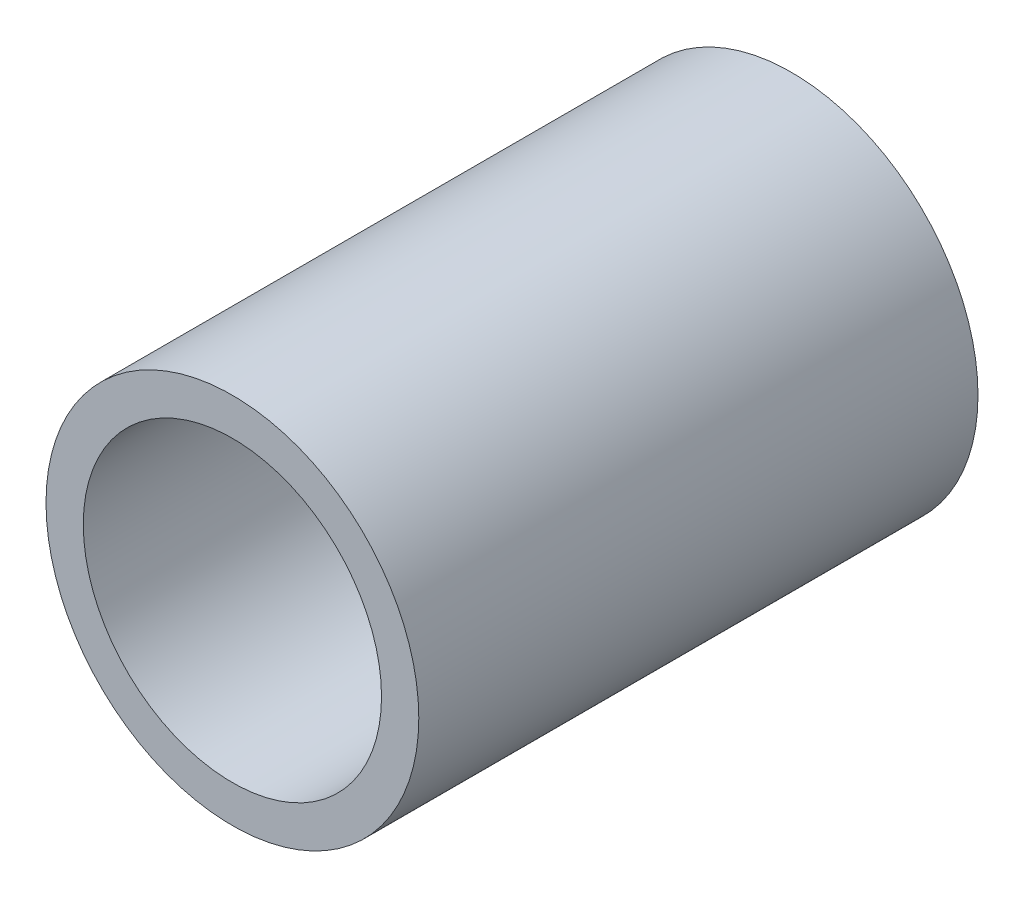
from build123d import *

# Parameters (mm, degrees)
ESQUISSE1_R          = 20
ESQUISSE1_R_2        = 16
BASE_EXTRUSION_DEPTH = 60


with BuildPart() as part:
    # Esquisse1 → Base-Extrusion (new body)
    with BuildSketch(Plane.XY):
        Circle(ESQUISSE1_R)
        Circle(ESQUISSE1_R_2, mode=Mode.SUBTRACT)
    extrude(amount=BASE_EXTRUSION_DEPTH)


solid = part.part
